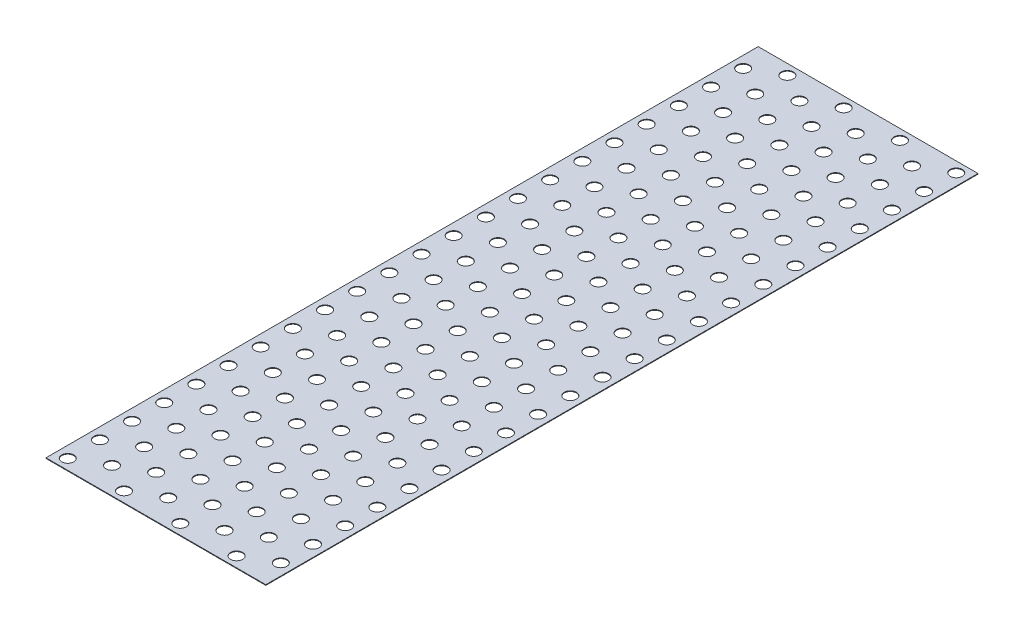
from build123d import *

# Parameters (mm, degrees)
CROQUIS1_W              = 173.575
CROQUIS1_H              = 562.452
SALIENTE_EXTRUIR1_DEPTH = 0.5
CROQUIS2_R              = 4.7625
CORTAR_EXTRUIR1_DEPTH   = 0.5


with BuildPart() as part:
    # Croquis1 → Saliente-Extruir1 (new body)
    with BuildSketch(Plane(origin=(0, 0, 0), x_dir=(1, 0, 0), z_dir=(0, 1, 0))):
        with Locations((86.7875, 281.226)):
            Rectangle(CROQUIS1_W, CROQUIS1_H)
    extrude(amount=SALIENTE_EXTRUIR1_DEPTH)

    # Croquis2 → Cortar-Extruir1 (cut)
    with BuildSketch(Plane(origin=(0, 0.5, 0), x_dir=(1, 0, 0), z_dir=(0, 1, 0))):
        with Locations(Location((9, 541.576, 0), (0, 0, 270))):
            Circle(CROQUIS2_R)
        with Locations(Location((53.45, 541.576, 0), (0, 0, 270))):
            Circle(CROQUIS2_R)
        with Locations(Location((97.9, 541.576, 0), (0, 0, 270))):
            Circle(CROQUIS2_R)
        with Locations(Location((142.35, 541.576, 0), (0, 0, 270))):
            Circle(CROQUIS2_R)
        with Locations(Location((9, 516.176, 0), (0, 0, 270))):
            Circle(CROQUIS2_R)
        with Locations(Location((53.45, 516.176, 0), (0, 0, 270))):
            Circle(CROQUIS2_R)
        with Locations(Location((97.9, 516.176, 0), (0, 0, 270))):
            Circle(CROQUIS2_R)
        with Locations(Location((142.35, 516.176, 0), (0, 0, 270))):
            Circle(CROQUIS2_R)
        with Locations(Location((9, 490.776, 0), (0, 0, 270))):
            Circle(CROQUIS2_R)
        with Locations(Location((53.45, 490.776, 0), (0, 0, 270))):
            Circle(CROQUIS2_R)
        with Locations(Location((97.9, 490.776, 0), (0, 0, 270))):
            Circle(CROQUIS2_R)
        with Locations(Location((142.35, 490.776, 0), (0, 0, 270))):
            Circle(CROQUIS2_R)
        with Locations(Location((9, 465.376, 0), (0, 0, 270))):
            Circle(CROQUIS2_R)
        with Locations(Location((53.45, 465.376, 0), (0, 0, 270))):
            Circle(CROQUIS2_R)
        with Locations(Location((97.9, 465.376, 0), (0, 0, 270))):
            Circle(CROQUIS2_R)
        with Locations(Location((142.35, 465.376, 0), (0, 0, 270))):
            Circle(CROQUIS2_R)
        with Locations(Location((9, 439.976, 0), (0, 0, 270))):
            Circle(CROQUIS2_R)
        with Locations(Location((53.45, 439.976, 0), (0, 0, 270))):
            Circle(CROQUIS2_R)
        with Locations(Location((97.9, 439.976, 0), (0, 0, 270))):
            Circle(CROQUIS2_R)
        with Locations(Location((142.35, 439.976, 0), (0, 0, 270))):
            Circle(CROQUIS2_R)
        with Locations(Location((9, 414.576, 0), (0, 0, 270))):
            Circle(CROQUIS2_R)
        with Locations(Location((53.45, 414.576, 0), (0, 0, 270))):
            Circle(CROQUIS2_R)
        with Locations(Location((97.9, 414.576, 0), (0, 0, 270))):
            Circle(CROQUIS2_R)
        with Locations(Location((142.35, 414.576, 0), (0, 0, 270))):
            Circle(CROQUIS2_R)
        with Locations(Location((9, 389.176, 0), (0, 0, 270))):
            Circle(CROQUIS2_R)
        with Locations(Location((53.45, 389.176, 0), (0, 0, 270))):
            Circle(CROQUIS2_R)
        with Locations(Location((97.9, 389.176, 0), (0, 0, 270))):
            Circle(CROQUIS2_R)
        with Locations(Location((142.35, 389.176, 0), (0, 0, 270))):
            Circle(CROQUIS2_R)
        with Locations(Location((9, 363.776, 0), (0, 0, 270))):
            Circle(CROQUIS2_R)
        with Locations(Location((53.45, 363.776, 0), (0, 0, 270))):
            Circle(CROQUIS2_R)
        with Locations(Location((97.9, 363.776, 0), (0, 0, 270))):
            Circle(CROQUIS2_R)
        with Locations(Location((142.35, 363.776, 0), (0, 0, 270))):
            Circle(CROQUIS2_R)
        with Locations(Location((9, 338.376, 0), (0, 0, 270))):
            Circle(CROQUIS2_R)
        with Locations(Location((53.45, 338.376, 0), (0, 0, 270))):
            Circle(CROQUIS2_R)
        with Locations(Location((97.9, 338.376, 0), (0, 0, 270))):
            Circle(CROQUIS2_R)
        with Locations(Location((142.35, 338.376, 0), (0, 0, 270))):
            Circle(CROQUIS2_R)
        with Locations(Location((9, 312.976, 0), (0, 0, 270))):
            Circle(CROQUIS2_R)
        with Locations(Location((53.45, 312.976, 0), (0, 0, 270))):
            Circle(CROQUIS2_R)
        with Locations(Location((97.9, 312.976, 0), (0, 0, 270))):
            Circle(CROQUIS2_R)
        with Locations(Location((142.35, 312.976, 0), (0, 0, 270))):
            Circle(CROQUIS2_R)
        with Locations(Location((9, 287.576, 0), (0, 0, 270))):
            Circle(CROQUIS2_R)
        with Locations(Location((53.45, 287.576, 0), (0, 0, 270))):
            Circle(CROQUIS2_R)
        with Locations(Location((97.9, 287.576, 0), (0, 0, 270))):
            Circle(CROQUIS2_R)
        with Locations(Location((142.35, 287.576, 0), (0, 0, 270))):
            Circle(CROQUIS2_R)
        with Locations(Location((9, 262.176, 0), (0, 0, 270))):
            Circle(CROQUIS2_R)
        with Locations(Location((53.45, 262.176, 0), (0, 0, 270))):
            Circle(CROQUIS2_R)
        with Locations(Location((97.9, 262.176, 0), (0, 0, 270))):
            Circle(CROQUIS2_R)
        with Locations(Location((142.35, 262.176, 0), (0, 0, 270))):
            Circle(CROQUIS2_R)
        with Locations(Location((9, 236.776, 0), (0, 0, 270))):
            Circle(CROQUIS2_R)
        with Locations(Location((53.45, 236.776, 0), (0, 0, 270))):
            Circle(CROQUIS2_R)
        with Locations(Location((97.9, 236.776, 0), (0, 0, 270))):
            Circle(CROQUIS2_R)
        with Locations(Location((142.35, 236.776, 0), (0, 0, 270))):
            Circle(CROQUIS2_R)
        with Locations(Location((9, 211.376, 0), (0, 0, 270))):
            Circle(CROQUIS2_R)
        with Locations(Location((53.45, 211.376, 0), (0, 0, 270))):
            Circle(CROQUIS2_R)
        with Locations(Location((97.9, 211.376, 0), (0, 0, 270))):
            Circle(CROQUIS2_R)
        with Locations(Location((142.35, 211.376, 0), (0, 0, 270))):
            Circle(CROQUIS2_R)
        with Locations(Location((9, 185.976, 0), (0, 0, 270))):
            Circle(CROQUIS2_R)
        with Locations(Location((53.45, 185.976, 0), (0, 0, 270))):
            Circle(CROQUIS2_R)
        with Locations(Location((97.9, 185.976, 0), (0, 0, 270))):
            Circle(CROQUIS2_R)
        with Locations(Location((142.35, 185.976, 0), (0, 0, 270))):
            Circle(CROQUIS2_R)
        with Locations(Location((9, 160.576, 0), (0, 0, 270))):
            Circle(CROQUIS2_R)
        with Locations(Location((53.45, 160.576, 0), (0, 0, 270))):
            Circle(CROQUIS2_R)
        with Locations(Location((97.9, 160.576, 0), (0, 0, 270))):
            Circle(CROQUIS2_R)
        with Locations(Location((142.35, 160.576, 0), (0, 0, 270))):
            Circle(CROQUIS2_R)
        with Locations(Location((9, 135.176, 0), (0, 0, 270))):
            Circle(CROQUIS2_R)
        with Locations(Location((53.45, 135.176, 0), (0, 0, 270))):
            Circle(CROQUIS2_R)
        with Locations(Location((97.9, 135.176, 0), (0, 0, 270))):
            Circle(CROQUIS2_R)
        with Locations(Location((142.35, 135.176, 0), (0, 0, 270))):
            Circle(CROQUIS2_R)
        with Locations(Location((9, 109.776, 0), (0, 0, 270))):
            Circle(CROQUIS2_R)
        with Locations(Location((53.45, 109.776, 0), (0, 0, 270))):
            Circle(CROQUIS2_R)
        with Locations(Location((97.9, 109.776, 0), (0, 0, 270))):
            Circle(CROQUIS2_R)
        with Locations(Location((142.35, 109.776, 0), (0, 0, 270))):
            Circle(CROQUIS2_R)
        with Locations(Location((9, 84.376, 0), (0, 0, 270))):
            Circle(CROQUIS2_R)
        with Locations(Location((53.45, 84.376, 0), (0, 0, 270))):
            Circle(CROQUIS2_R)
        with Locations(Location((97.9, 84.376, 0), (0, 0, 270))):
            Circle(CROQUIS2_R)
        with Locations(Location((142.35, 84.376, 0), (0, 0, 270))):
            Circle(CROQUIS2_R)
        with Locations(Location((9, 58.976, 0), (0, 0, 270))):
            Circle(CROQUIS2_R)
        with Locations(Location((53.45, 58.976, 0), (0, 0, 270))):
            Circle(CROQUIS2_R)
        with Locations(Location((97.9, 58.976, 0), (0, 0, 270))):
            Circle(CROQUIS2_R)
        with Locations(Location((142.35, 58.976, 0), (0, 0, 270))):
            Circle(CROQUIS2_R)
        with Locations(Location((9, 33.576, 0), (0, 0, 270))):
            Circle(CROQUIS2_R)
        with Locations(Location((53.45, 33.576, 0), (0, 0, 270))):
            Circle(CROQUIS2_R)
        with Locations(Location((97.9, 33.576, 0), (0, 0, 270))):
            Circle(CROQUIS2_R)
        with Locations(Location((142.35, 33.576, 0), (0, 0, 270))):
            Circle(CROQUIS2_R)
        with Locations(Location((9, 8.176, 0), (0, 0, 270))):
            Circle(CROQUIS2_R)
        with Locations(Location((53.45, 8.176, 0), (0, 0, 270))):
            Circle(CROQUIS2_R)
        with Locations(Location((97.9, 8.176, 0), (0, 0, 270))):
            Circle(CROQUIS2_R)
        with Locations(Location((142.35, 8.176, 0), (0, 0, 270))):
            Circle(CROQUIS2_R)
        with Locations(Location((31.225, 554.276, 0), (0, 0, 270))):
            Circle(CROQUIS2_R)
        with Locations(Location((75.675, 554.276, 0), (0, 0, 270))):
            Circle(CROQUIS2_R)
        with Locations(Location((120.125, 554.276, 0), (0, 0, 270))):
            Circle(CROQUIS2_R)
        with Locations(Location((164.575, 554.276, 0), (0, 0, 270))):
            Circle(CROQUIS2_R)
        with Locations(Location((31.225, 528.876, 0), (0, 0, 270))):
            Circle(CROQUIS2_R)
        with Locations(Location((75.675, 528.876, 0), (0, 0, 270))):
            Circle(CROQUIS2_R)
        with Locations(Location((120.125, 528.876, 0), (0, 0, 270))):
            Circle(CROQUIS2_R)
        with Locations(Location((164.575, 528.876, 0), (0, 0, 270))):
            Circle(CROQUIS2_R)
        with Locations(Location((31.225, 503.476, 0), (0, 0, 270))):
            Circle(CROQUIS2_R)
        with Locations(Location((75.675, 503.476, 0), (0, 0, 270))):
            Circle(CROQUIS2_R)
        with Locations(Location((120.125, 503.476, 0), (0, 0, 270))):
            Circle(CROQUIS2_R)
        with Locations(Location((164.575, 503.476, 0), (0, 0, 270))):
            Circle(CROQUIS2_R)
        with Locations(Location((31.225, 478.076, 0), (0, 0, 270))):
            Circle(CROQUIS2_R)
        with Locations(Location((75.675, 478.076, 0), (0, 0, 270))):
            Circle(CROQUIS2_R)
        with Locations(Location((120.125, 478.076, 0), (0, 0, 270))):
            Circle(CROQUIS2_R)
        with Locations(Location((164.575, 478.076, 0), (0, 0, 270))):
            Circle(CROQUIS2_R)
        with Locations(Location((31.225, 452.676, 0), (0, 0, 270))):
            Circle(CROQUIS2_R)
        with Locations(Location((75.675, 452.676, 0), (0, 0, 270))):
            Circle(CROQUIS2_R)
        with Locations(Location((120.125, 452.676, 0), (0, 0, 270))):
            Circle(CROQUIS2_R)
        with Locations(Location((164.575, 452.676, 0), (0, 0, 270))):
            Circle(CROQUIS2_R)
        with Locations(Location((31.225, 427.276, 0), (0, 0, 270))):
            Circle(CROQUIS2_R)
        with Locations(Location((75.675, 427.276, 0), (0, 0, 270))):
            Circle(CROQUIS2_R)
        with Locations(Location((120.125, 427.276, 0), (0, 0, 270))):
            Circle(CROQUIS2_R)
        with Locations(Location((164.575, 427.276, 0), (0, 0, 270))):
            Circle(CROQUIS2_R)
        with Locations(Location((31.225, 401.876, 0), (0, 0, 270))):
            Circle(CROQUIS2_R)
        with Locations(Location((75.675, 401.876, 0), (0, 0, 270))):
            Circle(CROQUIS2_R)
        with Locations(Location((120.125, 401.876, 0), (0, 0, 270))):
            Circle(CROQUIS2_R)
        with Locations(Location((164.575, 401.876, 0), (0, 0, 270))):
            Circle(CROQUIS2_R)
        with Locations(Location((31.225, 376.476, 0), (0, 0, 270))):
            Circle(CROQUIS2_R)
        with Locations(Location((75.675, 376.476, 0), (0, 0, 270))):
            Circle(CROQUIS2_R)
        with Locations(Location((120.125, 376.476, 0), (0, 0, 270))):
            Circle(CROQUIS2_R)
        with Locations(Location((164.575, 376.476, 0), (0, 0, 270))):
            Circle(CROQUIS2_R)
        with Locations(Location((31.225, 351.076, 0), (0, 0, 270))):
            Circle(CROQUIS2_R)
        with Locations(Location((75.675, 351.076, 0), (0, 0, 270))):
            Circle(CROQUIS2_R)
        with Locations(Location((120.125, 351.076, 0), (0, 0, 270))):
            Circle(CROQUIS2_R)
        with Locations(Location((164.575, 351.076, 0), (0, 0, 270))):
            Circle(CROQUIS2_R)
        with Locations(Location((31.225, 325.676, 0), (0, 0, 270))):
            Circle(CROQUIS2_R)
        with Locations(Location((75.675, 325.676, 0), (0, 0, 270))):
            Circle(CROQUIS2_R)
        with Locations(Location((120.125, 325.676, 0), (0, 0, 270))):
            Circle(CROQUIS2_R)
        with Locations(Location((164.575, 325.676, 0), (0, 0, 270))):
            Circle(CROQUIS2_R)
        with Locations(Location((31.225, 300.276, 0), (0, 0, 270))):
            Circle(CROQUIS2_R)
        with Locations(Location((75.675, 300.276, 0), (0, 0, 270))):
            Circle(CROQUIS2_R)
        with Locations(Location((120.125, 300.276, 0), (0, 0, 270))):
            Circle(CROQUIS2_R)
        with Locations(Location((164.575, 300.276, 0), (0, 0, 270))):
            Circle(CROQUIS2_R)
        with Locations(Location((31.225, 274.876, 0), (0, 0, 270))):
            Circle(CROQUIS2_R)
        with Locations(Location((75.675, 274.876, 0), (0, 0, 270))):
            Circle(CROQUIS2_R)
        with Locations(Location((120.125, 274.876, 0), (0, 0, 270))):
            Circle(CROQUIS2_R)
        with Locations(Location((164.575, 274.876, 0), (0, 0, 270))):
            Circle(CROQUIS2_R)
        with Locations(Location((31.225, 249.476, 0), (0, 0, 270))):
            Circle(CROQUIS2_R)
        with Locations(Location((75.675, 249.476, 0), (0, 0, 270))):
            Circle(CROQUIS2_R)
        with Locations(Location((120.125, 249.476, 0), (0, 0, 270))):
            Circle(CROQUIS2_R)
        with Locations(Location((164.575, 249.476, 0), (0, 0, 270))):
            Circle(CROQUIS2_R)
        with Locations(Location((31.225, 224.076, 0), (0, 0, 270))):
            Circle(CROQUIS2_R)
        with Locations(Location((75.675, 224.076, 0), (0, 0, 270))):
            Circle(CROQUIS2_R)
        with Locations(Location((120.125, 224.076, 0), (0, 0, 270))):
            Circle(CROQUIS2_R)
        with Locations(Location((164.575, 224.076, 0), (0, 0, 270))):
            Circle(CROQUIS2_R)
        with Locations(Location((31.225, 198.676, 0), (0, 0, 270))):
            Circle(CROQUIS2_R)
        with Locations(Location((75.675, 198.676, 0), (0, 0, 270))):
            Circle(CROQUIS2_R)
        with Locations(Location((120.125, 198.676, 0), (0, 0, 270))):
            Circle(CROQUIS2_R)
        with Locations(Location((164.575, 198.676, 0), (0, 0, 270))):
            Circle(CROQUIS2_R)
        with Locations(Location((31.225, 173.276, 0), (0, 0, 270))):
            Circle(CROQUIS2_R)
        with Locations(Location((75.675, 173.276, 0), (0, 0, 270))):
            Circle(CROQUIS2_R)
        with Locations(Location((120.125, 173.276, 0), (0, 0, 270))):
            Circle(CROQUIS2_R)
        with Locations(Location((164.575, 173.276, 0), (0, 0, 270))):
            Circle(CROQUIS2_R)
        with Locations(Location((31.225, 147.876, 0), (0, 0, 270))):
            Circle(CROQUIS2_R)
        with Locations(Location((75.675, 147.876, 0), (0, 0, 270))):
            Circle(CROQUIS2_R)
        with Locations(Location((120.125, 147.876, 0), (0, 0, 270))):
            Circle(CROQUIS2_R)
        with Locations(Location((164.575, 147.876, 0), (0, 0, 270))):
            Circle(CROQUIS2_R)
        with Locations(Location((31.225, 122.476, 0), (0, 0, 270))):
            Circle(CROQUIS2_R)
        with Locations(Location((75.675, 122.476, 0), (0, 0, 270))):
            Circle(CROQUIS2_R)
        with Locations(Location((120.125, 122.476, 0), (0, 0, 270))):
            Circle(CROQUIS2_R)
        with Locations(Location((164.575, 122.476, 0), (0, 0, 270))):
            Circle(CROQUIS2_R)
        with Locations(Location((31.225, 97.076, 0), (0, 0, 270))):
            Circle(CROQUIS2_R)
        with Locations(Location((75.675, 97.076, 0), (0, 0, 270))):
            Circle(CROQUIS2_R)
        with Locations(Location((120.125, 97.076, 0), (0, 0, 270))):
            Circle(CROQUIS2_R)
        with Locations(Location((164.575, 97.076, 0), (0, 0, 270))):
            Circle(CROQUIS2_R)
        with Locations(Location((31.225, 71.676, 0), (0, 0, 270))):
            Circle(CROQUIS2_R)
        with Locations(Location((75.675, 71.676, 0), (0, 0, 270))):
            Circle(CROQUIS2_R)
        with Locations(Location((120.125, 71.676, 0), (0, 0, 270))):
            Circle(CROQUIS2_R)
        with Locations(Location((164.575, 71.676, 0), (0, 0, 270))):
            Circle(CROQUIS2_R)
        with Locations(Location((31.225, 46.276, 0), (0, 0, 270))):
            Circle(CROQUIS2_R)
        with Locations(Location((75.675, 46.276, 0), (0, 0, 270))):
            Circle(CROQUIS2_R)
        with Locations(Location((120.125, 46.276, 0), (0, 0, 270))):
            Circle(CROQUIS2_R)
        with Locations(Location((164.575, 46.276, 0), (0, 0, 270))):
            Circle(CROQUIS2_R)
        with Locations(Location((31.225, 20.876, 0), (0, 0, 270))):
            Circle(CROQUIS2_R)
        with Locations(Location((75.675, 20.876, 0), (0, 0, 270))):
            Circle(CROQUIS2_R)
        with Locations(Location((120.125, 20.876, 0), (0, 0, 270))):
            Circle(CROQUIS2_R)
        with Locations(Location((164.575, 20.876, 0), (0, 0, 270))):
            Circle(CROQUIS2_R)
    extrude(amount=-CORTAR_EXTRUIR1_DEPTH, mode=Mode.SUBTRACT)


solid = part.part
